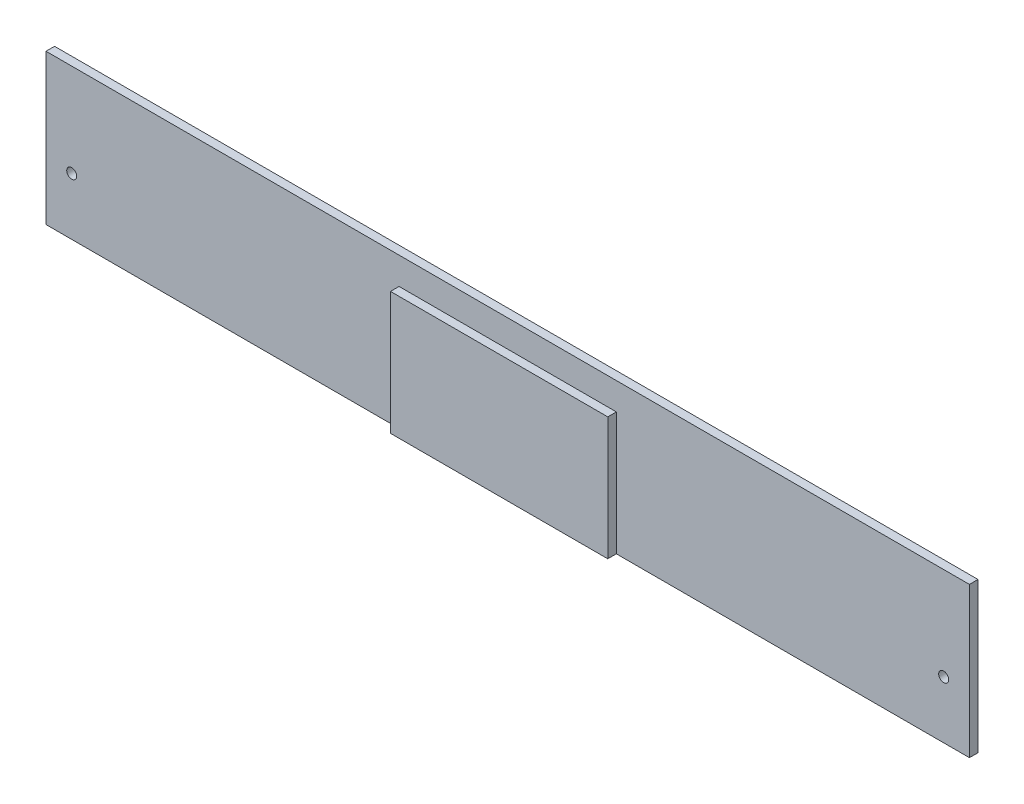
ISO-10303-21;
HEADER;
FILE_DESCRIPTION(('STEP AP214'),'2;1');
FILE_NAME('part.step','',(''),(''),'','','');
FILE_SCHEMA(('AUTOMOTIVE_DESIGN { 1 0 10303 214 1 1 1 1 }'));
ENDSEC;
DATA;
#1=APPLICATION_CONTEXT('core data for automotive mechanical design processes');
#2=APPLICATION_PROTOCOL_DEFINITION('international standard','automotive_design',2000,#1);
#3=PRODUCT_CONTEXT('',#1,'mechanical');
#4=PRODUCT('Part','Part','',(#3));
#5=PRODUCT_RELATED_PRODUCT_CATEGORY('part','',(#4));
#6=PRODUCT_DEFINITION_FORMATION('','',#4);
#7=PRODUCT_DEFINITION_CONTEXT('part definition',#1,'design');
#8=PRODUCT_DEFINITION('design','',#6,#7);
#9=PRODUCT_DEFINITION_SHAPE('','',#8);
#10=(LENGTH_UNIT() NAMED_UNIT(*) SI_UNIT(.MILLI.,.METRE.));
#11=(NAMED_UNIT(*) PLANE_ANGLE_UNIT() SI_UNIT($,.RADIAN.));
#12=(NAMED_UNIT(*) SI_UNIT($,.STERADIAN.) SOLID_ANGLE_UNIT());
#13=UNCERTAINTY_MEASURE_WITH_UNIT(LENGTH_MEASURE(1.E-05),#10,'distance_accuracy_value','');
#14=(GEOMETRIC_REPRESENTATION_CONTEXT(3) GLOBAL_UNCERTAINTY_ASSIGNED_CONTEXT((#13)) GLOBAL_UNIT_ASSIGNED_CONTEXT((#10,
#11,#12)) REPRESENTATION_CONTEXT('',''));
#15=CARTESIAN_POINT('',(0.,0.,0.));
#16=DIRECTION('',(0.,0.,1.));
#17=DIRECTION('',(1.,0.,0.));
#18=AXIS2_PLACEMENT_3D('',#15,#16,#17);
#19=CARTESIAN_POINT('',(161.5,25.,3.));
#20=DIRECTION('',(-1.,0.,0.));
#21=DIRECTION('',(0.,0.,1.));
#22=AXIS2_PLACEMENT_3D('',#19,#20,#21);
#23=PLANE('',#22);
#24=DIRECTION('',(0.,1.,0.));
#25=VECTOR('',#24,1.);
#26=CARTESIAN_POINT('',(161.5,25.,0.));
#27=LINE('',#26,#25);
#28=CARTESIAN_POINT('',(161.5,-25.,0.));
#29=VERTEX_POINT('',#28);
#30=CARTESIAN_POINT('',(161.5,27.5,0.));
#31=VERTEX_POINT('',#30);
#32=EDGE_CURVE('E275',#29,#31,#27,.T.);
#33=ORIENTED_EDGE('',*,*,#32,.T.);
#34=DIRECTION('',(0.,0.,-1.));
#35=VECTOR('',#34,1.);
#36=CARTESIAN_POINT('',(161.5,27.5,3.));
#37=LINE('',#36,#35);
#38=CARTESIAN_POINT('',(161.5,27.5,3.));
#39=VERTEX_POINT('',#38);
#40=EDGE_CURVE('E240',#39,#31,#37,.T.);
#41=ORIENTED_EDGE('',*,*,#40,.F.);
#42=DIRECTION('',(0.,1.,0.));
#43=VECTOR('',#42,1.);
#44=CARTESIAN_POINT('',(161.5,25.,3.));
#45=LINE('',#44,#43);
#46=CARTESIAN_POINT('',(161.5,-25.,3.));
#47=VERTEX_POINT('',#46);
#48=EDGE_CURVE('E276',#47,#39,#45,.T.);
#49=ORIENTED_EDGE('',*,*,#48,.F.);
#50=DIRECTION('',(0.,0.,-1.));
#51=VECTOR('',#50,1.);
#52=CARTESIAN_POINT('',(161.5,-25.,3.));
#53=LINE('',#52,#51);
#54=EDGE_CURVE('E284',#47,#29,#53,.T.);
#55=ORIENTED_EDGE('',*,*,#54,.T.);
#56=EDGE_LOOP('',(#33,#41,#49,#55));
#57=FACE_BOUND('',#56,.T.);
#58=ADVANCED_FACE('F43',(#57),#23,.F.);
#59=CARTESIAN_POINT('',(-161.5,25.,3.));
#60=DIRECTION('',(1.,0.,0.));
#61=DIRECTION('',(0.,0.,-1.));
#62=AXIS2_PLACEMENT_3D('',#59,#60,#61);
#63=PLANE('',#62);
#64=DIRECTION('',(0.,-1.,0.));
#65=VECTOR('',#64,1.);
#66=CARTESIAN_POINT('',(-161.5,25.,0.));
#67=LINE('',#66,#65);
#68=CARTESIAN_POINT('',(-161.5,27.5,0.));
#69=VERTEX_POINT('',#68);
#70=CARTESIAN_POINT('',(-161.5,-25.,0.));
#71=VERTEX_POINT('',#70);
#72=EDGE_CURVE('E286',#69,#71,#67,.T.);
#73=ORIENTED_EDGE('',*,*,#72,.T.);
#74=DIRECTION('',(0.,0.,-1.));
#75=VECTOR('',#74,1.);
#76=CARTESIAN_POINT('',(-161.5,-25.,3.));
#77=LINE('',#76,#75);
#78=CARTESIAN_POINT('',(-161.5,-25.,3.));
#79=VERTEX_POINT('',#78);
#80=EDGE_CURVE('E293',#79,#71,#77,.T.);
#81=ORIENTED_EDGE('',*,*,#80,.F.);
#82=DIRECTION('',(0.,-1.,0.));
#83=VECTOR('',#82,1.);
#84=CARTESIAN_POINT('',(-161.5,25.,3.));
#85=LINE('',#84,#83);
#86=CARTESIAN_POINT('',(-161.5,27.5,3.));
#87=VERTEX_POINT('',#86);
#88=EDGE_CURVE('E278',#87,#79,#85,.T.);
#89=ORIENTED_EDGE('',*,*,#88,.F.);
#90=DIRECTION('',(0.,0.,1.));
#91=VECTOR('',#90,1.);
#92=CARTESIAN_POINT('',(-161.5,27.5,0.));
#93=LINE('',#92,#91);
#94=EDGE_CURVE('E255',#69,#87,#93,.T.);
#95=ORIENTED_EDGE('',*,*,#94,.F.);
#96=EDGE_LOOP('',(#73,#81,#89,#95));
#97=FACE_BOUND('',#96,.T.);
#98=ADVANCED_FACE('F364',(#97),#63,.F.);
#99=CARTESIAN_POINT('',(-161.5,-25.,3.));
#100=DIRECTION('',(0.,1.,0.));
#101=DIRECTION('',(0.,0.,1.));
#102=AXIS2_PLACEMENT_3D('',#99,#100,#101);
#103=PLANE('',#102);
#104=DIRECTION('',(0.,0.,-1.));
#105=VECTOR('',#104,1.);
#106=CARTESIAN_POINT('',(38.,-25.,0.));
#107=LINE('',#106,#105);
#108=CARTESIAN_POINT('',(38.,-25.,0.));
#109=VERTEX_POINT('',#108);
#110=CARTESIAN_POINT('',(38.,-25.,-43.));
#111=VERTEX_POINT('',#110);
#112=EDGE_CURVE('E214',#109,#111,#107,.T.);
#113=ORIENTED_EDGE('',*,*,#112,.F.);
#114=DIRECTION('',(1.,0.,0.));
#115=VECTOR('',#114,1.);
#116=CARTESIAN_POINT('',(-161.5,-25.,0.));
#117=LINE('',#116,#115);
#118=EDGE_CURVE('E288',#109,#29,#117,.T.);
#119=ORIENTED_EDGE('',*,*,#118,.T.);
#120=ORIENTED_EDGE('',*,*,#54,.F.);
#121=DIRECTION('',(1.,0.,0.));
#122=VECTOR('',#121,1.);
#123=CARTESIAN_POINT('',(-161.5,-25.,3.));
#124=LINE('',#123,#122);
#125=CARTESIAN_POINT('',(38.,-25.,3.));
#126=VERTEX_POINT('',#125);
#127=EDGE_CURVE('E281',#126,#47,#124,.T.);
#128=ORIENTED_EDGE('',*,*,#127,.F.);
#129=DIRECTION('',(0.,0.,-1.));
#130=VECTOR('',#129,1.);
#131=CARTESIAN_POINT('',(38.,-25.,0.));
#132=LINE('',#131,#130);
#133=CARTESIAN_POINT('',(38.,-25.,6.00000000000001));
#134=VERTEX_POINT('',#133);
#135=EDGE_CURVE('E176',#134,#126,#132,.T.);
#136=ORIENTED_EDGE('',*,*,#135,.F.);
#137=DIRECTION('',(1.,0.,0.));
#138=VECTOR('',#137,1.);
#139=CARTESIAN_POINT('',(-38.,-25.0000000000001,6.00000000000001));
#140=LINE('',#139,#138);
#141=CARTESIAN_POINT('',(-38.,-25.0000000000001,6.00000000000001));
#142=VERTEX_POINT('',#141);
#143=EDGE_CURVE('E168',#142,#134,#140,.T.);
#144=ORIENTED_EDGE('',*,*,#143,.F.);
#145=DIRECTION('',(0.,0.,-1.));
#146=VECTOR('',#145,1.);
#147=CARTESIAN_POINT('',(-38.,-25.0000000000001,0.));
#148=LINE('',#147,#146);
#149=CARTESIAN_POINT('',(-38.,-25.0000000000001,3.));
#150=VERTEX_POINT('',#149);
#151=EDGE_CURVE('E173',#142,#150,#148,.T.);
#152=ORIENTED_EDGE('',*,*,#151,.T.);
#153=EDGE_CURVE('E282',#79,#150,#124,.T.);
#154=ORIENTED_EDGE('',*,*,#153,.F.);
#155=ORIENTED_EDGE('',*,*,#80,.T.);
#156=CARTESIAN_POINT('',(-38.,-25.,0.));
#157=VERTEX_POINT('',#156);
#158=EDGE_CURVE('E279',#71,#157,#117,.T.);
#159=ORIENTED_EDGE('',*,*,#158,.T.);
#160=DIRECTION('',(0.,0.,-1.));
#161=VECTOR('',#160,1.);
#162=CARTESIAN_POINT('',(-38.,-25.0000000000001,0.));
#163=LINE('',#162,#161);
#164=CARTESIAN_POINT('',(-38.,-25.0000000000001,-43.));
#165=VERTEX_POINT('',#164);
#166=EDGE_CURVE('E217',#157,#165,#163,.T.);
#167=ORIENTED_EDGE('',*,*,#166,.T.);
#168=DIRECTION('',(1.,0.,0.));
#169=VECTOR('',#168,1.);
#170=CARTESIAN_POINT('',(-38.,-25.0000000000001,-43.));
#171=LINE('',#170,#169);
#172=EDGE_CURVE('E228',#165,#111,#171,.T.);
#173=ORIENTED_EDGE('',*,*,#172,.T.);
#174=EDGE_LOOP('',(#113,#119,#120,#128,#136,#144,#152,#154,#155,#159,#167,#173));
#175=FACE_BOUND('',#174,.T.);
#176=ADVANCED_FACE('F171',(#175),#103,.F.);
#177=CARTESIAN_POINT('',(0.,0.,3.));
#178=DIRECTION('',(0.,0.,1.));
#179=DIRECTION('',(1.,0.,0.));
#180=AXIS2_PLACEMENT_3D('',#177,#178,#179);
#181=PLANE('',#180);
#182=DIRECTION('',(0.,1.,0.));
#183=VECTOR('',#182,1.);
#184=CARTESIAN_POINT('',(38.,0.,3.));
#185=LINE('',#184,#183);
#186=CARTESIAN_POINT('',(38.,18.,3.));
#187=VERTEX_POINT('',#186);
#188=EDGE_CURVE('E58',#126,#187,#185,.T.);
#189=ORIENTED_EDGE('',*,*,#188,.F.);
#190=ORIENTED_EDGE('',*,*,#127,.T.);
#191=ORIENTED_EDGE('',*,*,#48,.T.);
#192=DIRECTION('',(1.,0.,0.));
#193=VECTOR('',#192,1.);
#194=CARTESIAN_POINT('',(-161.5,27.5,3.));
#195=LINE('',#194,#193);
#196=EDGE_CURVE('E258',#87,#39,#195,.T.);
#197=ORIENTED_EDGE('',*,*,#196,.F.);
#198=ORIENTED_EDGE('',*,*,#88,.T.);
#199=ORIENTED_EDGE('',*,*,#153,.T.);
#200=DIRECTION('',(0.,1.,0.));
#201=VECTOR('',#200,1.);
#202=CARTESIAN_POINT('',(-38.,0.,3.));
#203=LINE('',#202,#201);
#204=CARTESIAN_POINT('',(-38.,17.9999999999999,3.));
#205=VERTEX_POINT('',#204);
#206=EDGE_CURVE('E191',#150,#205,#203,.T.);
#207=ORIENTED_EDGE('',*,*,#206,.T.);
#208=DIRECTION('',(1.,0.,0.));
#209=VECTOR('',#208,1.);
#210=CARTESIAN_POINT('',(-38.,17.9999999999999,3.));
#211=LINE('',#210,#209);
#212=EDGE_CURVE('E200',#205,#187,#211,.T.);
#213=ORIENTED_EDGE('',*,*,#212,.T.);
#214=EDGE_LOOP('',(#189,#190,#191,#197,#198,#199,#207,#213));
#215=FACE_BOUND('',#214,.T.);
#216=CARTESIAN_POINT('',(-152.5,-5.,3.));
#217=DIRECTION('',(0.,0.,1.));
#218=DIRECTION('',(1.,0.,0.));
#219=AXIS2_PLACEMENT_3D('',#216,#217,#218);
#220=CIRCLE('',#219,1.75000000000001);
#221=CARTESIAN_POINT('',(-150.75,-5.,3.));
#222=VERTEX_POINT('',#221);
#223=EDGE_CURVE('E241',#222,#222,#220,.T.);
#224=ORIENTED_EDGE('',*,*,#223,.F.);
#225=EDGE_LOOP('',(#224));
#226=FACE_BOUND('',#225,.T.);
#227=CARTESIAN_POINT('',(152.5,-4.99999999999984,3.));
#228=DIRECTION('',(0.,0.,1.));
#229=DIRECTION('',(-1.,0.,0.));
#230=AXIS2_PLACEMENT_3D('',#227,#228,#229);
#231=CIRCLE('',#230,1.75000000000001);
#232=CARTESIAN_POINT('',(150.75,-4.99999999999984,3.));
#233=VERTEX_POINT('',#232);
#234=EDGE_CURVE('E244',#233,#233,#231,.T.);
#235=ORIENTED_EDGE('',*,*,#234,.F.);
#236=EDGE_LOOP('',(#235));
#237=FACE_BOUND('',#236,.T.);
#238=ADVANCED_FACE('F375',(#215,#226,#237),#181,.T.);
#239=CARTESIAN_POINT('',(0.,0.,0.));
#240=DIRECTION('',(0.,0.,1.));
#241=DIRECTION('',(1.,0.,0.));
#242=AXIS2_PLACEMENT_3D('',#239,#240,#241);
#243=PLANE('',#242);
#244=CARTESIAN_POINT('',(-152.5,-5.,0.));
#245=DIRECTION('',(0.,0.,1.));
#246=DIRECTION('',(1.,0.,0.));
#247=AXIS2_PLACEMENT_3D('',#244,#245,#246);
#248=CIRCLE('',#247,1.75000000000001);
#249=CARTESIAN_POINT('',(-150.75,-5.,0.));
#250=VERTEX_POINT('',#249);
#251=EDGE_CURVE('E237',#250,#250,#248,.T.);
#252=ORIENTED_EDGE('',*,*,#251,.T.);
#253=EDGE_LOOP('',(#252));
#254=FACE_BOUND('',#253,.T.);
#255=CARTESIAN_POINT('',(152.5,-4.99999999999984,0.));
#256=DIRECTION('',(0.,0.,1.));
#257=DIRECTION('',(-1.,0.,0.));
#258=AXIS2_PLACEMENT_3D('',#255,#256,#257);
#259=CIRCLE('',#258,1.75000000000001);
#260=CARTESIAN_POINT('',(150.75,-4.99999999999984,0.));
#261=VERTEX_POINT('',#260);
#262=EDGE_CURVE('E247',#261,#261,#259,.T.);
#263=ORIENTED_EDGE('',*,*,#262,.T.);
#264=EDGE_LOOP('',(#263));
#265=FACE_BOUND('',#264,.T.);
#266=DIRECTION('',(0.,-1.,0.));
#267=VECTOR('',#266,1.);
#268=CARTESIAN_POINT('',(-35.,-25.,0.));
#269=LINE('',#268,#267);
#270=CARTESIAN_POINT('',(-35.,13.,0.));
#271=VERTEX_POINT('',#270);
#272=CARTESIAN_POINT('',(-35.,-23.0000000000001,0.));
#273=VERTEX_POINT('',#272);
#274=EDGE_CURVE('E261',#271,#273,#269,.T.);
#275=ORIENTED_EDGE('',*,*,#274,.T.);
#276=DIRECTION('',(-1.,0.,0.));
#277=VECTOR('',#276,1.);
#278=CARTESIAN_POINT('',(0.,-23.0000000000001,0.));
#279=LINE('',#278,#277);
#280=CARTESIAN_POINT('',(-38.,-23.0000000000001,0.));
#281=VERTEX_POINT('',#280);
#282=EDGE_CURVE('E65',#273,#281,#279,.T.);
#283=ORIENTED_EDGE('',*,*,#282,.T.);
#284=DIRECTION('',(0.,-1.,0.));
#285=VECTOR('',#284,1.);
#286=CARTESIAN_POINT('',(-38.,0.,0.));
#287=LINE('',#286,#285);
#288=EDGE_CURVE('E11',#281,#157,#287,.T.);
#289=ORIENTED_EDGE('',*,*,#288,.T.);
#290=ORIENTED_EDGE('',*,*,#158,.F.);
#291=ORIENTED_EDGE('',*,*,#72,.F.);
#292=DIRECTION('',(-1.,0.,0.));
#293=VECTOR('',#292,1.);
#294=CARTESIAN_POINT('',(161.5,27.5,0.));
#295=LINE('',#294,#293);
#296=EDGE_CURVE('E252',#31,#69,#295,.T.);
#297=ORIENTED_EDGE('',*,*,#296,.F.);
#298=ORIENTED_EDGE('',*,*,#32,.F.);
#299=ORIENTED_EDGE('',*,*,#118,.F.);
#300=DIRECTION('',(0.,-1.,0.));
#301=VECTOR('',#300,1.);
#302=CARTESIAN_POINT('',(38.,0.,0.));
#303=LINE('',#302,#301);
#304=CARTESIAN_POINT('',(38.,-23.,0.));
#305=VERTEX_POINT('',#304);
#306=EDGE_CURVE('E51',#305,#109,#303,.T.);
#307=ORIENTED_EDGE('',*,*,#306,.F.);
#308=CARTESIAN_POINT('',(35.,-23.,0.));
#309=VERTEX_POINT('',#308);
#310=EDGE_CURVE('E233',#305,#309,#279,.T.);
#311=ORIENTED_EDGE('',*,*,#310,.T.);
#312=DIRECTION('',(0.,1.,0.));
#313=VECTOR('',#312,1.);
#314=CARTESIAN_POINT('',(35.,-25.,0.));
#315=LINE('',#314,#313);
#316=CARTESIAN_POINT('',(35.,13.,0.));
#317=VERTEX_POINT('',#316);
#318=EDGE_CURVE('E263',#309,#317,#315,.T.);
#319=ORIENTED_EDGE('',*,*,#318,.T.);
#320=CARTESIAN_POINT('',(33.,13.,0.));
#321=DIRECTION('',(0.,0.,1.));
#322=DIRECTION('',(1.,0.,0.));
#323=AXIS2_PLACEMENT_3D('',#320,#321,#322);
#324=CIRCLE('',#323,2.);
#325=CARTESIAN_POINT('',(33.,15.,0.));
#326=VERTEX_POINT('',#325);
#327=EDGE_CURVE('E310',#317,#326,#324,.T.);
#328=ORIENTED_EDGE('',*,*,#327,.T.);
#329=DIRECTION('',(-1.,0.,0.));
#330=VECTOR('',#329,1.);
#331=CARTESIAN_POINT('',(-35.,15.,0.));
#332=LINE('',#331,#330);
#333=CARTESIAN_POINT('',(-33.,15.,0.));
#334=VERTEX_POINT('',#333);
#335=EDGE_CURVE('E265',#326,#334,#332,.T.);
#336=ORIENTED_EDGE('',*,*,#335,.T.);
#337=CARTESIAN_POINT('',(-33.,13.,0.));
#338=DIRECTION('',(0.,0.,1.));
#339=DIRECTION('',(1.,0.,0.));
#340=AXIS2_PLACEMENT_3D('',#337,#338,#339);
#341=CIRCLE('',#340,2.);
#342=EDGE_CURVE('E315',#334,#271,#341,.T.);
#343=ORIENTED_EDGE('',*,*,#342,.T.);
#344=EDGE_LOOP('',(#275,#283,#289,#290,#291,#297,#298,#299,#307,#311,#319,#328,#336,#343));
#345=FACE_BOUND('',#344,.T.);
#346=ADVANCED_FACE('F335',(#254,#265,#345),#243,.F.);
#347=CARTESIAN_POINT('',(-35.,-25.,0.));
#348=DIRECTION('',(-1.,0.,0.));
#349=DIRECTION('',(0.,0.,1.));
#350=AXIS2_PLACEMENT_3D('',#347,#348,#349);
#351=PLANE('',#350);
#352=DIRECTION('',(0.,-1.,0.));
#353=VECTOR('',#352,1.);
#354=CARTESIAN_POINT('',(-35.,0.,3.));
#355=LINE('',#354,#353);
#356=CARTESIAN_POINT('',(-35.,13.,3.));
#357=VERTEX_POINT('',#356);
#358=CARTESIAN_POINT('',(-35.,-23.,3.));
#359=VERTEX_POINT('',#358);
#360=EDGE_CURVE('E273',#357,#359,#355,.T.);
#361=ORIENTED_EDGE('',*,*,#360,.T.);
#362=DIRECTION('',(0.,0.,-1.));
#363=VECTOR('',#362,1.);
#364=CARTESIAN_POINT('',(-35.,-23.0000000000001,0.));
#365=LINE('',#364,#363);
#366=EDGE_CURVE('E235',#359,#273,#365,.T.);
#367=ORIENTED_EDGE('',*,*,#366,.T.);
#368=ORIENTED_EDGE('',*,*,#274,.F.);
#369=DIRECTION('',(0.,0.,1.));
#370=VECTOR('',#369,1.);
#371=CARTESIAN_POINT('',(-35.,13.,3.));
#372=LINE('',#371,#370);
#373=EDGE_CURVE('E304',#271,#357,#372,.T.);
#374=ORIENTED_EDGE('',*,*,#373,.T.);
#375=EDGE_LOOP('',(#361,#367,#368,#374));
#376=FACE_BOUND('',#375,.T.);
#377=ADVANCED_FACE('F357',(#376),#351,.F.);
#378=CARTESIAN_POINT('',(-35.,15.,0.));
#379=DIRECTION('',(0.,1.,0.));
#380=DIRECTION('',(0.,0.,1.));
#381=AXIS2_PLACEMENT_3D('',#378,#379,#380);
#382=PLANE('',#381);
#383=ORIENTED_EDGE('',*,*,#335,.F.);
#384=DIRECTION('',(0.,0.,1.));
#385=VECTOR('',#384,1.);
#386=CARTESIAN_POINT('',(33.,15.,3.));
#387=LINE('',#386,#385);
#388=CARTESIAN_POINT('',(33.,15.,3.));
#389=VERTEX_POINT('',#388);
#390=EDGE_CURVE('E298',#326,#389,#387,.T.);
#391=ORIENTED_EDGE('',*,*,#390,.T.);
#392=DIRECTION('',(-1.,0.,0.));
#393=VECTOR('',#392,1.);
#394=CARTESIAN_POINT('',(0.,15.,3.));
#395=LINE('',#394,#393);
#396=CARTESIAN_POINT('',(-33.,15.,3.));
#397=VERTEX_POINT('',#396);
#398=EDGE_CURVE('E271',#389,#397,#395,.T.);
#399=ORIENTED_EDGE('',*,*,#398,.T.);
#400=DIRECTION('',(0.,0.,1.));
#401=VECTOR('',#400,1.);
#402=CARTESIAN_POINT('',(-33.,15.,0.));
#403=LINE('',#402,#401);
#404=EDGE_CURVE('E296',#397,#334,#403,.F.);
#405=ORIENTED_EDGE('',*,*,#404,.T.);
#406=EDGE_LOOP('',(#383,#391,#399,#405));
#407=FACE_BOUND('',#406,.T.);
#408=ADVANCED_FACE('F346',(#407),#382,.F.);
#409=CARTESIAN_POINT('',(35.,-25.,0.));
#410=DIRECTION('',(1.,0.,0.));
#411=DIRECTION('',(0.,1.,0.));
#412=AXIS2_PLACEMENT_3D('',#409,#410,#411);
#413=PLANE('',#412);
#414=ORIENTED_EDGE('',*,*,#318,.F.);
#415=DIRECTION('',(0.,0.,1.));
#416=VECTOR('',#415,1.);
#417=CARTESIAN_POINT('',(35.,-23.,0.));
#418=LINE('',#417,#416);
#419=CARTESIAN_POINT('',(35.,-23.,3.));
#420=VERTEX_POINT('',#419);
#421=EDGE_CURVE('E317',#309,#420,#418,.T.);
#422=ORIENTED_EDGE('',*,*,#421,.T.);
#423=DIRECTION('',(0.,1.,0.));
#424=VECTOR('',#423,1.);
#425=CARTESIAN_POINT('',(35.,0.,3.));
#426=LINE('',#425,#424);
#427=CARTESIAN_POINT('',(35.,13.,3.));
#428=VERTEX_POINT('',#427);
#429=EDGE_CURVE('E268',#420,#428,#426,.T.);
#430=ORIENTED_EDGE('',*,*,#429,.T.);
#431=DIRECTION('',(0.,0.,1.));
#432=VECTOR('',#431,1.);
#433=CARTESIAN_POINT('',(35.,13.,0.));
#434=LINE('',#433,#432);
#435=EDGE_CURVE('E301',#428,#317,#434,.F.);
#436=ORIENTED_EDGE('',*,*,#435,.T.);
#437=EDGE_LOOP('',(#414,#422,#430,#436));
#438=FACE_BOUND('',#437,.T.);
#439=ADVANCED_FACE('F337',(#438),#413,.F.);
#440=CARTESIAN_POINT('',(33.,13.,0.));
#441=DIRECTION('',(0.,0.,-1.));
#442=DIRECTION('',(-1.,0.,0.));
#443=AXIS2_PLACEMENT_3D('',#440,#441,#442);
#444=CYLINDRICAL_SURFACE('',#443,2.);
#445=ORIENTED_EDGE('',*,*,#327,.F.);
#446=ORIENTED_EDGE('',*,*,#435,.F.);
#447=CARTESIAN_POINT('',(33.,13.,3.));
#448=DIRECTION('',(0.,0.,1.));
#449=DIRECTION('',(1.,0.,0.));
#450=AXIS2_PLACEMENT_3D('',#447,#448,#449);
#451=CIRCLE('',#450,2.);
#452=EDGE_CURVE('E307',#389,#428,#451,.F.);
#453=ORIENTED_EDGE('',*,*,#452,.F.);
#454=ORIENTED_EDGE('',*,*,#390,.F.);
#455=EDGE_LOOP('',(#445,#446,#453,#454));
#456=FACE_BOUND('',#455,.T.);
#457=ADVANCED_FACE('F342',(#456),#444,.F.);
#458=CARTESIAN_POINT('',(-33.,13.,0.));
#459=DIRECTION('',(0.,0.,-1.));
#460=DIRECTION('',(-1.,0.,0.));
#461=AXIS2_PLACEMENT_3D('',#458,#459,#460);
#462=CYLINDRICAL_SURFACE('',#461,2.);
#463=ORIENTED_EDGE('',*,*,#342,.F.);
#464=ORIENTED_EDGE('',*,*,#404,.F.);
#465=CARTESIAN_POINT('',(-33.,13.,3.));
#466=DIRECTION('',(0.,0.,1.));
#467=DIRECTION('',(1.,0.,0.));
#468=AXIS2_PLACEMENT_3D('',#465,#466,#467);
#469=CIRCLE('',#468,2.);
#470=EDGE_CURVE('E312',#357,#397,#469,.F.);
#471=ORIENTED_EDGE('',*,*,#470,.F.);
#472=ORIENTED_EDGE('',*,*,#373,.F.);
#473=EDGE_LOOP('',(#463,#464,#471,#472));
#474=FACE_BOUND('',#473,.T.);
#475=ADVANCED_FACE('F45',(#474),#462,.F.);
#476=CARTESIAN_POINT('',(0.,27.5,0.));
#477=DIRECTION('',(0.,1.,0.));
#478=DIRECTION('',(0.,0.,1.));
#479=AXIS2_PLACEMENT_3D('',#476,#477,#478);
#480=PLANE('',#479);
#481=ORIENTED_EDGE('',*,*,#40,.T.);
#482=ORIENTED_EDGE('',*,*,#296,.T.);
#483=ORIENTED_EDGE('',*,*,#94,.T.);
#484=ORIENTED_EDGE('',*,*,#196,.T.);
#485=EDGE_LOOP('',(#481,#482,#483,#484));
#486=FACE_BOUND('',#485,.T.);
#487=ADVANCED_FACE('F369',(#486),#480,.T.);
#488=CARTESIAN_POINT('',(152.5,-4.99999999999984,0.));
#489=DIRECTION('',(0.,0.,1.));
#490=DIRECTION('',(1.,0.,0.));
#491=AXIS2_PLACEMENT_3D('',#488,#489,#490);
#492=CYLINDRICAL_SURFACE('',#491,1.75000000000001);
#493=ORIENTED_EDGE('',*,*,#262,.F.);
#494=EDGE_LOOP('',(#493));
#495=FACE_BOUND('',#494,.T.);
#496=ORIENTED_EDGE('',*,*,#234,.T.);
#497=EDGE_LOOP('',(#496));
#498=FACE_BOUND('',#497,.T.);
#499=ADVANCED_FACE('F499',(#495,#498),#492,.F.);
#500=CARTESIAN_POINT('',(-152.5,-5.,0.));
#501=DIRECTION('',(0.,0.,1.));
#502=DIRECTION('',(1.,0.,0.));
#503=AXIS2_PLACEMENT_3D('',#500,#501,#502);
#504=CYLINDRICAL_SURFACE('',#503,1.75000000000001);
#505=ORIENTED_EDGE('',*,*,#251,.F.);
#506=EDGE_LOOP('',(#505));
#507=FACE_BOUND('',#506,.T.);
#508=ORIENTED_EDGE('',*,*,#223,.T.);
#509=EDGE_LOOP('',(#508));
#510=FACE_BOUND('',#509,.T.);
#511=ADVANCED_FACE('F423',(#507,#510),#504,.F.);
#512=CARTESIAN_POINT('',(-38.,0.,0.));
#513=DIRECTION('',(-1.,0.,0.));
#514=DIRECTION('',(0.,-1.,0.));
#515=AXIS2_PLACEMENT_3D('',#512,#513,#514);
#516=PLANE('',#515);
#517=ORIENTED_EDGE('',*,*,#288,.F.);
#518=DIRECTION('',(0.,0.,1.));
#519=VECTOR('',#518,1.);
#520=CARTESIAN_POINT('',(-38.,-23.0000000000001,0.));
#521=LINE('',#520,#519);
#522=CARTESIAN_POINT('',(-38.,-23.0000000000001,-43.));
#523=VERTEX_POINT('',#522);
#524=EDGE_CURVE('E210',#523,#281,#521,.T.);
#525=ORIENTED_EDGE('',*,*,#524,.F.);
#526=DIRECTION('',(0.,1.,0.));
#527=VECTOR('',#526,1.);
#528=CARTESIAN_POINT('',(-38.,0.,-43.));
#529=LINE('',#528,#527);
#530=EDGE_CURVE('E213',#165,#523,#529,.T.);
#531=ORIENTED_EDGE('',*,*,#530,.F.);
#532=ORIENTED_EDGE('',*,*,#166,.F.);
#533=EDGE_LOOP('',(#517,#525,#531,#532));
#534=FACE_BOUND('',#533,.T.);
#535=ADVANCED_FACE('F360',(#534),#516,.T.);
#536=CARTESIAN_POINT('',(38.,0.,0.));
#537=DIRECTION('',(-1.,0.,0.));
#538=DIRECTION('',(0.,-1.,0.));
#539=AXIS2_PLACEMENT_3D('',#536,#537,#538);
#540=PLANE('',#539);
#541=DIRECTION('',(0.,0.,1.));
#542=VECTOR('',#541,1.);
#543=CARTESIAN_POINT('',(38.,-23.,0.));
#544=LINE('',#543,#542);
#545=CARTESIAN_POINT('',(38.,-23.,-43.));
#546=VERTEX_POINT('',#545);
#547=EDGE_CURVE('E181',#546,#305,#544,.T.);
#548=ORIENTED_EDGE('',*,*,#547,.T.);
#549=ORIENTED_EDGE('',*,*,#306,.T.);
#550=ORIENTED_EDGE('',*,*,#112,.T.);
#551=DIRECTION('',(0.,1.,0.));
#552=VECTOR('',#551,1.);
#553=CARTESIAN_POINT('',(38.,0.,-43.));
#554=LINE('',#553,#552);
#555=EDGE_CURVE('E222',#111,#546,#554,.T.);
#556=ORIENTED_EDGE('',*,*,#555,.T.);
#557=EDGE_LOOP('',(#548,#549,#550,#556));
#558=FACE_BOUND('',#557,.T.);
#559=ADVANCED_FACE('F320',(#558),#540,.F.);
#560=CARTESIAN_POINT('',(-38.,-23.0000000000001,0.));
#561=DIRECTION('',(0.,1.,0.));
#562=DIRECTION('',(-1.,0.,0.));
#563=AXIS2_PLACEMENT_3D('',#560,#561,#562);
#564=PLANE('',#563);
#565=ORIENTED_EDGE('',*,*,#282,.F.);
#566=ORIENTED_EDGE('',*,*,#366,.F.);
#567=DIRECTION('',(1.,0.,0.));
#568=VECTOR('',#567,1.);
#569=CARTESIAN_POINT('',(-38.,-23.0000000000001,3.));
#570=LINE('',#569,#568);
#571=EDGE_CURVE('E219',#359,#420,#570,.T.);
#572=ORIENTED_EDGE('',*,*,#571,.T.);
#573=ORIENTED_EDGE('',*,*,#421,.F.);
#574=ORIENTED_EDGE('',*,*,#310,.F.);
#575=ORIENTED_EDGE('',*,*,#547,.F.);
#576=DIRECTION('',(1.,0.,0.));
#577=VECTOR('',#576,1.);
#578=CARTESIAN_POINT('',(-38.,-23.0000000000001,-43.));
#579=LINE('',#578,#577);
#580=EDGE_CURVE('E231',#523,#546,#579,.T.);
#581=ORIENTED_EDGE('',*,*,#580,.F.);
#582=ORIENTED_EDGE('',*,*,#524,.T.);
#583=EDGE_LOOP('',(#565,#566,#572,#573,#574,#575,#581,#582));
#584=FACE_BOUND('',#583,.T.);
#585=ADVANCED_FACE('F332',(#584),#564,.T.);
#586=CARTESIAN_POINT('',(-38.,0.,-43.));
#587=DIRECTION('',(0.,0.,-1.));
#588=DIRECTION('',(-1.,0.,0.));
#589=AXIS2_PLACEMENT_3D('',#586,#587,#588);
#590=PLANE('',#589);
#591=ORIENTED_EDGE('',*,*,#555,.F.);
#592=ORIENTED_EDGE('',*,*,#172,.F.);
#593=ORIENTED_EDGE('',*,*,#530,.T.);
#594=ORIENTED_EDGE('',*,*,#580,.T.);
#595=EDGE_LOOP('',(#591,#592,#593,#594));
#596=FACE_BOUND('',#595,.T.);
#597=ADVANCED_FACE('F329',(#596),#590,.T.);
#598=CARTESIAN_POINT('',(38.,0.,0.));
#599=DIRECTION('',(-1.,0.,0.));
#600=DIRECTION('',(0.,-1.,0.));
#601=AXIS2_PLACEMENT_3D('',#598,#599,#600);
#602=PLANE('',#601);
#603=ORIENTED_EDGE('',*,*,#135,.T.);
#604=ORIENTED_EDGE('',*,*,#188,.T.);
#605=DIRECTION('',(0.,0.,1.));
#606=VECTOR('',#605,1.);
#607=CARTESIAN_POINT('',(38.,18.,0.));
#608=LINE('',#607,#606);
#609=CARTESIAN_POINT('',(38.,18.,6.));
#610=VERTEX_POINT('',#609);
#611=EDGE_CURVE('E204',#187,#610,#608,.T.);
#612=ORIENTED_EDGE('',*,*,#611,.T.);
#613=DIRECTION('',(0.,-1.,0.));
#614=VECTOR('',#613,1.);
#615=CARTESIAN_POINT('',(38.,0.,6.));
#616=LINE('',#615,#614);
#617=EDGE_CURVE('E202',#610,#134,#616,.T.);
#618=ORIENTED_EDGE('',*,*,#617,.T.);
#619=EDGE_LOOP('',(#603,#604,#612,#618));
#620=FACE_BOUND('',#619,.T.);
#621=ADVANCED_FACE('F379',(#620),#602,.F.);
#622=CARTESIAN_POINT('',(-38.,0.,0.));
#623=DIRECTION('',(-1.,0.,0.));
#624=DIRECTION('',(0.,-1.,0.));
#625=AXIS2_PLACEMENT_3D('',#622,#623,#624);
#626=PLANE('',#625);
#627=ORIENTED_EDGE('',*,*,#151,.F.);
#628=DIRECTION('',(0.,-1.,0.));
#629=VECTOR('',#628,1.);
#630=CARTESIAN_POINT('',(-38.,0.,6.));
#631=LINE('',#630,#629);
#632=CARTESIAN_POINT('',(-38.,17.9999999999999,6.));
#633=VERTEX_POINT('',#632);
#634=EDGE_CURVE('E188',#633,#142,#631,.T.);
#635=ORIENTED_EDGE('',*,*,#634,.F.);
#636=DIRECTION('',(0.,0.,1.));
#637=VECTOR('',#636,1.);
#638=CARTESIAN_POINT('',(-38.,17.9999999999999,0.));
#639=LINE('',#638,#637);
#640=EDGE_CURVE('E195',#205,#633,#639,.T.);
#641=ORIENTED_EDGE('',*,*,#640,.F.);
#642=ORIENTED_EDGE('',*,*,#206,.F.);
#643=EDGE_LOOP('',(#627,#635,#641,#642));
#644=FACE_BOUND('',#643,.T.);
#645=ADVANCED_FACE('F186',(#644),#626,.T.);
#646=CARTESIAN_POINT('',(-38.,17.9999999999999,0.));
#647=DIRECTION('',(0.,1.,0.));
#648=DIRECTION('',(-1.,0.,0.));
#649=AXIS2_PLACEMENT_3D('',#646,#647,#648);
#650=PLANE('',#649);
#651=ORIENTED_EDGE('',*,*,#611,.F.);
#652=ORIENTED_EDGE('',*,*,#212,.F.);
#653=ORIENTED_EDGE('',*,*,#640,.T.);
#654=DIRECTION('',(1.,0.,0.));
#655=VECTOR('',#654,1.);
#656=CARTESIAN_POINT('',(-38.,17.9999999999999,6.));
#657=LINE('',#656,#655);
#658=EDGE_CURVE('E182',#633,#610,#657,.T.);
#659=ORIENTED_EDGE('',*,*,#658,.T.);
#660=EDGE_LOOP('',(#651,#652,#653,#659));
#661=FACE_BOUND('',#660,.T.);
#662=ADVANCED_FACE('F378',(#661),#650,.T.);
#663=CARTESIAN_POINT('',(-38.,0.,6.));
#664=DIRECTION('',(0.,0.,1.));
#665=DIRECTION('',(0.,-1.,0.));
#666=AXIS2_PLACEMENT_3D('',#663,#664,#665);
#667=PLANE('',#666);
#668=ORIENTED_EDGE('',*,*,#617,.F.);
#669=ORIENTED_EDGE('',*,*,#658,.F.);
#670=ORIENTED_EDGE('',*,*,#634,.T.);
#671=ORIENTED_EDGE('',*,*,#143,.T.);
#672=EDGE_LOOP('',(#668,#669,#670,#671));
#673=FACE_BOUND('',#672,.T.);
#674=ADVANCED_FACE('F194',(#673),#667,.T.);
#675=CARTESIAN_POINT('',(-38.,0.,3.));
#676=DIRECTION('',(0.,0.,-1.));
#677=DIRECTION('',(0.,1.,0.));
#678=AXIS2_PLACEMENT_3D('',#675,#676,#677);
#679=PLANE('',#678);
#680=ORIENTED_EDGE('',*,*,#429,.F.);
#681=ORIENTED_EDGE('',*,*,#571,.F.);
#682=ORIENTED_EDGE('',*,*,#360,.F.);
#683=ORIENTED_EDGE('',*,*,#470,.T.);
#684=ORIENTED_EDGE('',*,*,#398,.F.);
#685=ORIENTED_EDGE('',*,*,#452,.T.);
#686=EDGE_LOOP('',(#680,#681,#682,#683,#684,#685));
#687=FACE_BOUND('',#686,.T.);
#688=ADVANCED_FACE('F353',(#687),#679,.T.);
#689=CLOSED_SHELL('',(#58,#98,#176,#238,#346,#377,#408,#439,#457,#475,#487,#499,#511,#535,#559,
#585,#597,#621,#645,#662,#674,#688));
#690=MANIFOLD_SOLID_BREP('B2',#689);
#691=ADVANCED_BREP_SHAPE_REPRESENTATION('',(#18,#690),#14);
#692=SHAPE_DEFINITION_REPRESENTATION(#9,#691);
ENDSEC;
END-ISO-10303-21;
